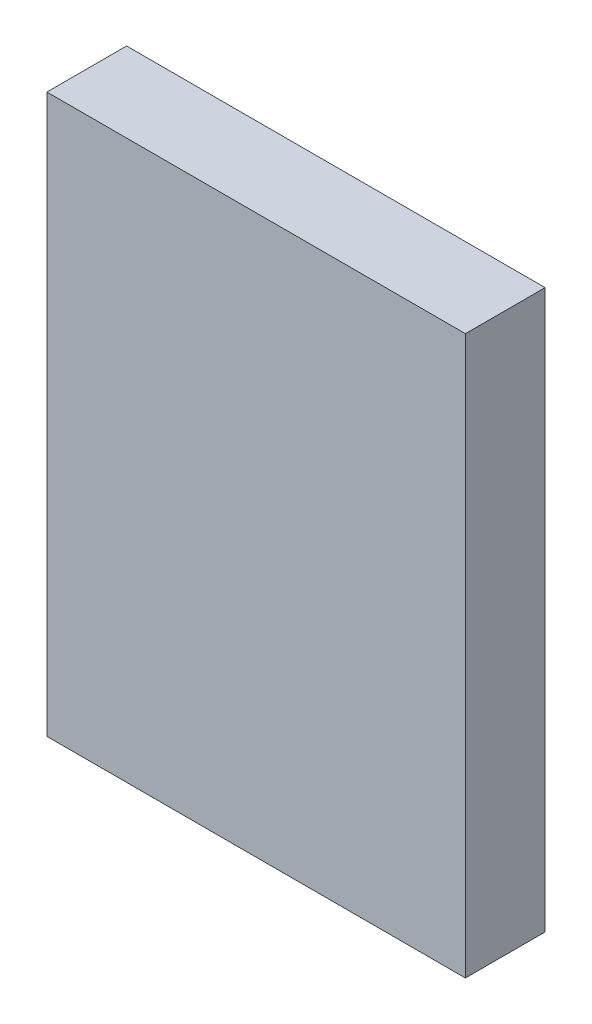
ISO-10303-21;
HEADER;
FILE_DESCRIPTION(('STEP AP214'),'2;1');
FILE_NAME('part.step','',(''),(''),'','','');
FILE_SCHEMA(('AUTOMOTIVE_DESIGN { 1 0 10303 214 1 1 1 1 }'));
ENDSEC;
DATA;
#1=APPLICATION_CONTEXT('core data for automotive mechanical design processes');
#2=APPLICATION_PROTOCOL_DEFINITION('international standard','automotive_design',2000,#1);
#3=PRODUCT_CONTEXT('',#1,'mechanical');
#4=PRODUCT('Part','Part','',(#3));
#5=PRODUCT_RELATED_PRODUCT_CATEGORY('part','',(#4));
#6=PRODUCT_DEFINITION_FORMATION('','',#4);
#7=PRODUCT_DEFINITION_CONTEXT('part definition',#1,'design');
#8=PRODUCT_DEFINITION('design','',#6,#7);
#9=PRODUCT_DEFINITION_SHAPE('','',#8);
#10=(LENGTH_UNIT() NAMED_UNIT(*) SI_UNIT(.MILLI.,.METRE.));
#11=(NAMED_UNIT(*) PLANE_ANGLE_UNIT() SI_UNIT($,.RADIAN.));
#12=(NAMED_UNIT(*) SI_UNIT($,.STERADIAN.) SOLID_ANGLE_UNIT());
#13=UNCERTAINTY_MEASURE_WITH_UNIT(LENGTH_MEASURE(1.E-05),#10,'distance_accuracy_value','');
#14=(GEOMETRIC_REPRESENTATION_CONTEXT(3) GLOBAL_UNCERTAINTY_ASSIGNED_CONTEXT((#13)) GLOBAL_UNIT_ASSIGNED_CONTEXT((#10,
#11,#12)) REPRESENTATION_CONTEXT('',''));
#15=CARTESIAN_POINT('',(0.,0.,0.));
#16=DIRECTION('',(0.,0.,1.));
#17=DIRECTION('',(1.,0.,0.));
#18=AXIS2_PLACEMENT_3D('',#15,#16,#17);
#19=CARTESIAN_POINT('',(0.,0.,40.));
#20=DIRECTION('',(1.,0.,0.));
#21=DIRECTION('',(0.,0.,-1.));
#22=AXIS2_PLACEMENT_3D('',#19,#20,#21);
#23=PLANE('',#22);
#24=DIRECTION('',(0.,-1.,0.));
#25=VECTOR('',#24,1.);
#26=CARTESIAN_POINT('',(0.,0.,0.));
#27=LINE('',#26,#25);
#28=CARTESIAN_POINT('',(0.,280.,0.));
#29=VERTEX_POINT('',#28);
#30=CARTESIAN_POINT('',(0.,0.,0.));
#31=VERTEX_POINT('',#30);
#32=EDGE_CURVE('E94',#29,#31,#27,.T.);
#33=ORIENTED_EDGE('',*,*,#32,.T.);
#34=DIRECTION('',(0.,0.,-1.));
#35=VECTOR('',#34,1.);
#36=CARTESIAN_POINT('',(0.,0.,40.));
#37=LINE('',#36,#35);
#38=CARTESIAN_POINT('',(0.,0.,40.));
#39=VERTEX_POINT('',#38);
#40=EDGE_CURVE('E11',#39,#31,#37,.T.);
#41=ORIENTED_EDGE('',*,*,#40,.F.);
#42=DIRECTION('',(0.,-1.,0.));
#43=VECTOR('',#42,1.);
#44=CARTESIAN_POINT('',(0.,0.,40.));
#45=LINE('',#44,#43);
#46=CARTESIAN_POINT('',(0.,280.,40.));
#47=VERTEX_POINT('',#46);
#48=EDGE_CURVE('E82',#47,#39,#45,.T.);
#49=ORIENTED_EDGE('',*,*,#48,.F.);
#50=DIRECTION('',(0.,0.,-1.));
#51=VECTOR('',#50,1.);
#52=CARTESIAN_POINT('',(0.,280.,40.));
#53=LINE('',#52,#51);
#54=EDGE_CURVE('E90',#47,#29,#53,.T.);
#55=ORIENTED_EDGE('',*,*,#54,.T.);
#56=EDGE_LOOP('',(#33,#41,#49,#55));
#57=FACE_BOUND('',#56,.T.);
#58=ADVANCED_FACE('F31',(#57),#23,.F.);
#59=CARTESIAN_POINT('',(0.,0.,40.));
#60=DIRECTION('',(0.,1.,0.));
#61=DIRECTION('',(0.,0.,1.));
#62=AXIS2_PLACEMENT_3D('',#59,#60,#61);
#63=PLANE('',#62);
#64=DIRECTION('',(1.,0.,0.));
#65=VECTOR('',#64,1.);
#66=CARTESIAN_POINT('',(0.,0.,0.));
#67=LINE('',#66,#65);
#68=CARTESIAN_POINT('',(210.,0.,0.));
#69=VERTEX_POINT('',#68);
#70=EDGE_CURVE('E86',#31,#69,#67,.T.);
#71=ORIENTED_EDGE('',*,*,#70,.T.);
#72=DIRECTION('',(0.,0.,-1.));
#73=VECTOR('',#72,1.);
#74=CARTESIAN_POINT('',(210.,0.,40.));
#75=LINE('',#74,#73);
#76=CARTESIAN_POINT('',(210.,0.,40.));
#77=VERTEX_POINT('',#76);
#78=EDGE_CURVE('E39',#77,#69,#75,.T.);
#79=ORIENTED_EDGE('',*,*,#78,.F.);
#80=DIRECTION('',(1.,0.,0.));
#81=VECTOR('',#80,1.);
#82=CARTESIAN_POINT('',(0.,0.,40.));
#83=LINE('',#82,#81);
#84=EDGE_CURVE('E77',#39,#77,#83,.T.);
#85=ORIENTED_EDGE('',*,*,#84,.F.);
#86=ORIENTED_EDGE('',*,*,#40,.T.);
#87=EDGE_LOOP('',(#71,#79,#85,#86));
#88=FACE_BOUND('',#87,.T.);
#89=ADVANCED_FACE('F85',(#88),#63,.F.);
#90=CARTESIAN_POINT('',(210.,0.,40.));
#91=DIRECTION('',(-1.,0.,0.));
#92=DIRECTION('',(0.,0.,1.));
#93=AXIS2_PLACEMENT_3D('',#90,#91,#92);
#94=PLANE('',#93);
#95=DIRECTION('',(0.,1.,0.));
#96=VECTOR('',#95,1.);
#97=CARTESIAN_POINT('',(210.,0.,0.));
#98=LINE('',#97,#96);
#99=CARTESIAN_POINT('',(210.,280.,0.));
#100=VERTEX_POINT('',#99);
#101=EDGE_CURVE('E64',#69,#100,#98,.T.);
#102=ORIENTED_EDGE('',*,*,#101,.T.);
#103=DIRECTION('',(0.,0.,-1.));
#104=VECTOR('',#103,1.);
#105=CARTESIAN_POINT('',(210.,280.,40.));
#106=LINE('',#105,#104);
#107=CARTESIAN_POINT('',(210.,280.,40.));
#108=VERTEX_POINT('',#107);
#109=EDGE_CURVE('E87',#108,#100,#106,.T.);
#110=ORIENTED_EDGE('',*,*,#109,.F.);
#111=DIRECTION('',(0.,1.,0.));
#112=VECTOR('',#111,1.);
#113=CARTESIAN_POINT('',(210.,0.,40.));
#114=LINE('',#113,#112);
#115=EDGE_CURVE('E80',#77,#108,#114,.T.);
#116=ORIENTED_EDGE('',*,*,#115,.F.);
#117=ORIENTED_EDGE('',*,*,#78,.T.);
#118=EDGE_LOOP('',(#102,#110,#116,#117));
#119=FACE_BOUND('',#118,.T.);
#120=ADVANCED_FACE('F88',(#119),#94,.F.);
#121=CARTESIAN_POINT('',(0.,280.,40.));
#122=DIRECTION('',(0.,-1.,0.));
#123=DIRECTION('',(0.,0.,-1.));
#124=AXIS2_PLACEMENT_3D('',#121,#122,#123);
#125=PLANE('',#124);
#126=DIRECTION('',(-1.,0.,0.));
#127=VECTOR('',#126,1.);
#128=CARTESIAN_POINT('',(0.,280.,0.));
#129=LINE('',#128,#127);
#130=EDGE_CURVE('E70',#100,#29,#129,.T.);
#131=ORIENTED_EDGE('',*,*,#130,.T.);
#132=ORIENTED_EDGE('',*,*,#54,.F.);
#133=DIRECTION('',(-1.,0.,0.));
#134=VECTOR('',#133,1.);
#135=CARTESIAN_POINT('',(0.,280.,40.));
#136=LINE('',#135,#134);
#137=EDGE_CURVE('E47',#108,#47,#136,.T.);
#138=ORIENTED_EDGE('',*,*,#137,.F.);
#139=ORIENTED_EDGE('',*,*,#109,.T.);
#140=EDGE_LOOP('',(#131,#132,#138,#139));
#141=FACE_BOUND('',#140,.T.);
#142=ADVANCED_FACE('F101',(#141),#125,.F.);
#143=CARTESIAN_POINT('',(0.,280.,40.));
#144=DIRECTION('',(0.,0.,-1.));
#145=DIRECTION('',(-1.,0.,0.));
#146=AXIS2_PLACEMENT_3D('',#143,#144,#145);
#147=PLANE('',#146);
#148=ORIENTED_EDGE('',*,*,#48,.T.);
#149=ORIENTED_EDGE('',*,*,#84,.T.);
#150=ORIENTED_EDGE('',*,*,#115,.T.);
#151=ORIENTED_EDGE('',*,*,#137,.T.);
#152=EDGE_LOOP('',(#148,#149,#150,#151));
#153=FACE_BOUND('',#152,.T.);
#154=ADVANCED_FACE('F78',(#153),#147,.F.);
#155=CARTESIAN_POINT('',(0.,280.,0.));
#156=DIRECTION('',(0.,0.,-1.));
#157=DIRECTION('',(-1.,0.,0.));
#158=AXIS2_PLACEMENT_3D('',#155,#156,#157);
#159=PLANE('',#158);
#160=ORIENTED_EDGE('',*,*,#32,.F.);
#161=ORIENTED_EDGE('',*,*,#130,.F.);
#162=ORIENTED_EDGE('',*,*,#101,.F.);
#163=ORIENTED_EDGE('',*,*,#70,.F.);
#164=EDGE_LOOP('',(#160,#161,#162,#163));
#165=FACE_BOUND('',#164,.T.);
#166=ADVANCED_FACE('F104',(#165),#159,.T.);
#167=CLOSED_SHELL('',(#58,#89,#120,#142,#154,#166));
#168=MANIFOLD_SOLID_BREP('B2',#167);
#169=ADVANCED_BREP_SHAPE_REPRESENTATION('',(#18,#168),#14);
#170=SHAPE_DEFINITION_REPRESENTATION(#9,#169);
ENDSEC;
END-ISO-10303-21;
